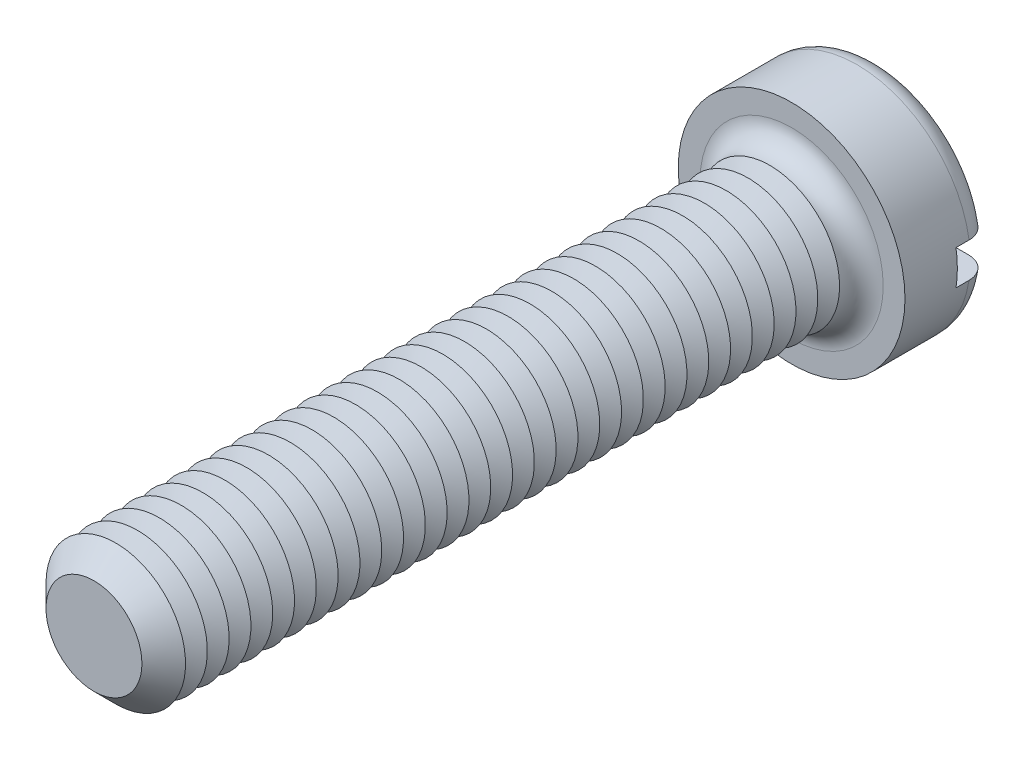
from build123d import *

# Parameters (mm, degrees)
SKETCH3_R           = 6.5
BOSS_EXTRUDE2_DEPTH = 5
SKETCH4_R           = 4
BOSS_EXTRUDE3_DEPTH = 40
FILLET1_R           = 1.25
CHAMFER1_SIZE       = 1.25
LPATTERN1_COUNT     = 30
LPATTERN1_PITCH     = 1.25
SKETCH8_W           = 13
SKETCH8_H           = 2
CUT_EXTRUDE1_DEPTH  = 2


with BuildPart() as part:
    # Sketch3 → Boss-Extrude2 (new body)
    with BuildSketch(Plane.XY):
        Circle(SKETCH3_R)
    extrude(amount=-BOSS_EXTRUDE2_DEPTH)

    # Sketch4 → Boss-Extrude3 (add)
    with BuildSketch(Plane.XY):
        Circle(SKETCH4_R)
    extrude(amount=BOSS_EXTRUDE3_DEPTH)

    # Fillet1
    fillet1_edges = [part.edges().sort_by_distance(p)[0] for p in [
        (-6.5, 0, -5),
        (-4, 0, 0),
    ]]
    fillet(fillet1_edges, radius=FILLET1_R)

    # Chamfer1
    chamfer1_edges = [part.edges().sort_by_distance(p)[0] for p in [
        (-4, 0, 40),
    ]]
    chamfer(chamfer1_edges, length=CHAMFER1_SIZE)

    # Sketch6 → Cut-Revolve1 (revolve, cut)
    with BuildSketch(Plane(origin=(0, 0, 0), x_dir=(0, 0, -1), z_dir=(1, 0, 0)), mode=Mode.PRIVATE) as cut_revolve1_sk:
        Polygon((-1.25, 4), (-1.875, 2.917468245), (-2.5, 4), align=None)
    cut_revolve1 = revolve(cut_revolve1_sk.sketch.rotate(Axis((0, 0, -1.694361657), (0, 0, 1)), 90), axis=Axis((0, 0, -1.694361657), (0, 0, 1)), mode=Mode.SUBTRACT)

    # LPattern1: Cut-Revolve1 ×30
    with Locations(*[(0, 0, i * LPATTERN1_PITCH) for i in range(1, LPATTERN1_COUNT)]):
        add(cut_revolve1, mode=Mode.SUBTRACT)

    # Sketch8 → Cut-Extrude1 (cut)
    with BuildSketch(Plane(origin=(0, 0, -5), x_dir=(-1, 0, 0), z_dir=(0, 0, -1))):
        Rectangle(SKETCH8_W, SKETCH8_H)
    extrude(amount=-CUT_EXTRUDE1_DEPTH, mode=Mode.SUBTRACT)


solid = part.part
